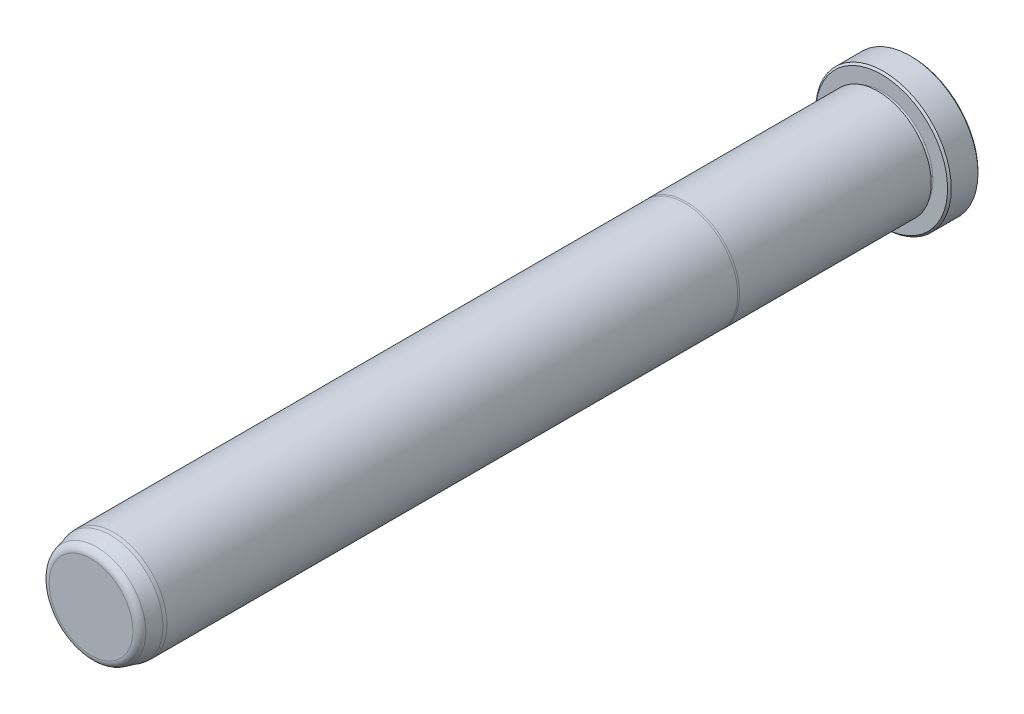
from build123d import *

# Parameters (mm, degrees)
FILLET6_R     = 1.5875
CHAMFER1_SIZE = 0.381


with BuildPart() as part:
    # Sketch1 → Revolve1 (revolve)
    with BuildSketch(Plane(origin=(0, 0, 0), x_dir=(0, 0, -1), z_dir=(1, 0, 0)), mode=Mode.PRIVATE) as revolve1_sk:
        with BuildLine():
            Line((0, 0), (0, 14.1605))
            Line((0, 14.1605), (-6.35, 14.1605))
            Line((-6.35, 14.1605), (-6.35, 10.7188))
            ThreePointArc((-6.35, 10.7188), (-6.731, 10.3378), (-7.112, 10.7188))
            Line((-7.112, 10.7188), (-7.112, 11.1252))
            Line((-7.112, 11.1252), (-47.134763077, 11.1252))
            Line((-47.134763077, 11.1252), (-47.498, 11.0998))
            Line((-47.498, 11.0998), (-166.6875, 11.0998))
            Line((-166.6875, 11.0998), (-167.4495, 11.033133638))
            Line((-167.4495, 11.033133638), (-171.45, 9.961202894))
            Line((-171.45, 9.961202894), (-171.45, 0))
            Line((-171.45, 0), (0, 0))
        make_face()
    revolve(revolve1_sk.sketch.rotate(Axis((0, 0, 0), (0, 0, -1)), 90), axis=Axis((0, 0, 0), (0, 0, -1)))

    # Fillet6
    fillet6_edges = [part.edges().sort_by_distance(p)[0] for p in [
        (-9.961202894, 0, 171.45),
    ]]
    fillet(fillet6_edges, radius=FILLET6_R)

    # Chamfer1
    chamfer1_edges = [part.edges().sort_by_distance(p)[0] for p in [
        (-14.1605, 0, 6.35),
        (-14.1605, 0, 0),
    ]]
    chamfer(chamfer1_edges, length=CHAMFER1_SIZE)


solid = part.part
